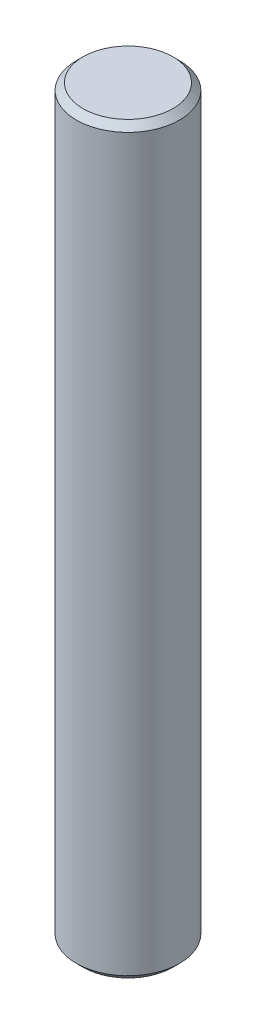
ISO-10303-21;
HEADER;
FILE_DESCRIPTION(('STEP AP214'),'2;1');
FILE_NAME('part.step','',(''),(''),'','','');
FILE_SCHEMA(('AUTOMOTIVE_DESIGN { 1 0 10303 214 1 1 1 1 }'));
ENDSEC;
DATA;
#1=APPLICATION_CONTEXT('core data for automotive mechanical design processes');
#2=APPLICATION_PROTOCOL_DEFINITION('international standard','automotive_design',2000,#1);
#3=PRODUCT_CONTEXT('',#1,'mechanical');
#4=PRODUCT('Part','Part','',(#3));
#5=PRODUCT_RELATED_PRODUCT_CATEGORY('part','',(#4));
#6=PRODUCT_DEFINITION_FORMATION('','',#4);
#7=PRODUCT_DEFINITION_CONTEXT('part definition',#1,'design');
#8=PRODUCT_DEFINITION('design','',#6,#7);
#9=PRODUCT_DEFINITION_SHAPE('','',#8);
#10=(LENGTH_UNIT() NAMED_UNIT(*) SI_UNIT(.MILLI.,.METRE.));
#11=(NAMED_UNIT(*) PLANE_ANGLE_UNIT() SI_UNIT($,.RADIAN.));
#12=(NAMED_UNIT(*) SI_UNIT($,.STERADIAN.) SOLID_ANGLE_UNIT());
#13=UNCERTAINTY_MEASURE_WITH_UNIT(LENGTH_MEASURE(1.E-05),#10,'distance_accuracy_value','');
#14=(GEOMETRIC_REPRESENTATION_CONTEXT(3) GLOBAL_UNCERTAINTY_ASSIGNED_CONTEXT((#13)) GLOBAL_UNIT_ASSIGNED_CONTEXT((#10,
#11,#12)) REPRESENTATION_CONTEXT('',''));
#15=CARTESIAN_POINT('',(0.,0.,0.));
#16=DIRECTION('',(0.,0.,1.));
#17=DIRECTION('',(1.,0.,0.));
#18=AXIS2_PLACEMENT_3D('',#15,#16,#17);
#19=CARTESIAN_POINT('',(0.,14.2875,0.));
#20=DIRECTION('',(0.,-1.,0.));
#21=DIRECTION('',(0.,0.,-1.));
#22=AXIS2_PLACEMENT_3D('',#19,#20,#21);
#23=CYLINDRICAL_SURFACE('',#22,1.9812);
#24=CARTESIAN_POINT('',(0.,-14.0335,0.));
#25=DIRECTION('',(0.,1.,0.));
#26=DIRECTION('',(0.,0.,1.));
#27=AXIS2_PLACEMENT_3D('',#24,#25,#26);
#28=CIRCLE('',#27,1.9812);
#29=CARTESIAN_POINT('',(0.,-14.0335,1.9812));
#30=VERTEX_POINT('',#29);
#31=EDGE_CURVE('E38',#30,#30,#28,.T.);
#32=ORIENTED_EDGE('',*,*,#31,.T.);
#33=EDGE_LOOP('',(#32));
#34=FACE_BOUND('',#33,.T.);
#35=CARTESIAN_POINT('',(0.,14.0335,0.));
#36=DIRECTION('',(0.,1.,0.));
#37=DIRECTION('',(0.,0.,1.));
#38=AXIS2_PLACEMENT_3D('',#35,#36,#37);
#39=CIRCLE('',#38,1.9812);
#40=CARTESIAN_POINT('',(0.,14.0335,1.9812));
#41=VERTEX_POINT('',#40);
#42=EDGE_CURVE('E42',#41,#41,#39,.F.);
#43=ORIENTED_EDGE('',*,*,#42,.T.);
#44=EDGE_LOOP('',(#43));
#45=FACE_BOUND('',#44,.T.);
#46=ADVANCED_FACE('F28',(#34,#45),#23,.T.);
#47=CARTESIAN_POINT('',(0.,14.2875,0.));
#48=DIRECTION('',(0.,1.,0.));
#49=DIRECTION('',(0.,0.,1.));
#50=AXIS2_PLACEMENT_3D('',#47,#48,#49);
#51=PLANE('',#50);
#52=CARTESIAN_POINT('',(0.,14.2875,0.));
#53=DIRECTION('',(0.,1.,0.));
#54=DIRECTION('',(0.,0.,1.));
#55=AXIS2_PLACEMENT_3D('',#52,#53,#54);
#56=CIRCLE('',#55,1.7272);
#57=CARTESIAN_POINT('',(0.,14.2875,1.7272));
#58=VERTEX_POINT('',#57);
#59=EDGE_CURVE('E10',#58,#58,#56,.T.);
#60=ORIENTED_EDGE('',*,*,#59,.T.);
#61=EDGE_LOOP('',(#60));
#62=FACE_BOUND('',#61,.T.);
#63=ADVANCED_FACE('F61',(#62),#51,.T.);
#64=CARTESIAN_POINT('',(0.,-14.2875,0.));
#65=DIRECTION('',(0.,1.,0.));
#66=DIRECTION('',(0.,0.,1.));
#67=AXIS2_PLACEMENT_3D('',#64,#65,#66);
#68=PLANE('',#67);
#69=CARTESIAN_POINT('',(0.,-14.2875,0.));
#70=DIRECTION('',(0.,1.,0.));
#71=DIRECTION('',(0.,0.,1.));
#72=AXIS2_PLACEMENT_3D('',#69,#70,#71);
#73=CIRCLE('',#72,1.7272);
#74=CARTESIAN_POINT('',(0.,-14.2875,1.7272));
#75=VERTEX_POINT('',#74);
#76=EDGE_CURVE('E34',#75,#75,#73,.F.);
#77=ORIENTED_EDGE('',*,*,#76,.T.);
#78=EDGE_LOOP('',(#77));
#79=FACE_BOUND('',#78,.T.);
#80=ADVANCED_FACE('F57',(#79),#68,.F.);
#81=CARTESIAN_POINT('',(0.,-14.0335,0.));
#82=DIRECTION('',(0.,1.,0.));
#83=DIRECTION('',(0.,0.,1.));
#84=AXIS2_PLACEMENT_3D('',#81,#82,#83);
#85=CONICAL_SURFACE('',#84,1.9812,0.785398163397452);
#86=ORIENTED_EDGE('',*,*,#76,.F.);
#87=EDGE_LOOP('',(#86));
#88=FACE_BOUND('',#87,.T.);
#89=ORIENTED_EDGE('',*,*,#31,.F.);
#90=EDGE_LOOP('',(#89));
#91=FACE_BOUND('',#90,.T.);
#92=ADVANCED_FACE('F52',(#88,#91),#85,.T.);
#93=CARTESIAN_POINT('',(0.,14.2875,0.));
#94=DIRECTION('',(0.,-1.,0.));
#95=DIRECTION('',(0.,0.,-1.));
#96=AXIS2_PLACEMENT_3D('',#93,#94,#95);
#97=CONICAL_SURFACE('',#96,1.7272,0.785398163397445);
#98=ORIENTED_EDGE('',*,*,#42,.F.);
#99=EDGE_LOOP('',(#98));
#100=FACE_BOUND('',#99,.T.);
#101=ORIENTED_EDGE('',*,*,#59,.F.);
#102=EDGE_LOOP('',(#101));
#103=FACE_BOUND('',#102,.T.);
#104=ADVANCED_FACE('F49',(#100,#103),#97,.T.);
#105=CLOSED_SHELL('',(#46,#63,#80,#92,#104));
#106=MANIFOLD_SOLID_BREP('B2',#105);
#107=ADVANCED_BREP_SHAPE_REPRESENTATION('',(#18,#106),#14);
#108=SHAPE_DEFINITION_REPRESENTATION(#9,#107);
ENDSEC;
END-ISO-10303-21;
